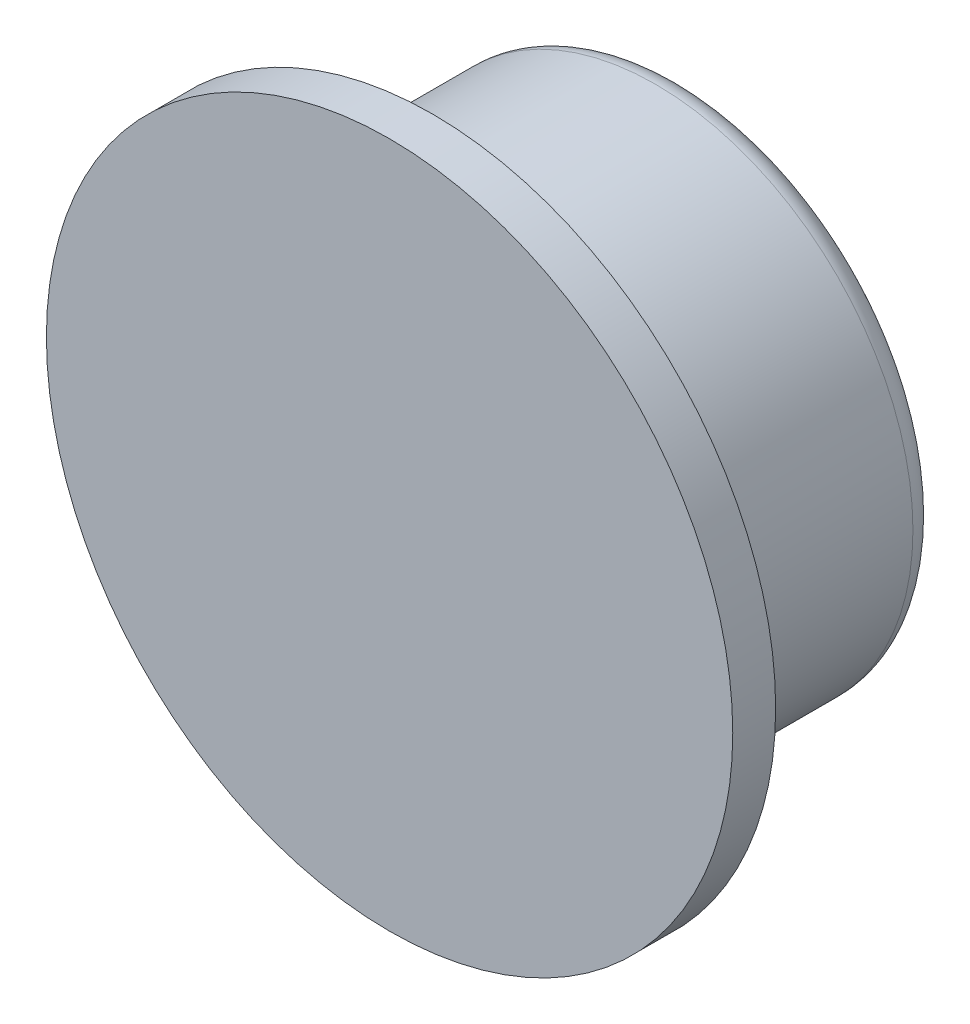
from build123d import *


with BuildPart() as part:
    # Sketch1 → Revolve1 (revolve)
    with BuildSketch(Plane(origin=(0, 0, 0), x_dir=(0, 0, -1), z_dir=(1, 0, 0)), mode=Mode.PRIVATE) as revolve1_sk:
        with BuildLine():
            Line((0, 0), (0, 40))
            Line((0, 40), (5, 40))
            Line((5, 40), (5, 30))
            Line((5, 30), (31, 30))
            ThreePointArc((31, 30), (33.121320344, 29.121320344), (34, 27))
            Line((34, 27), (34, 5.5))
            Line((34, 5.5), (33.5, 5))
            Line((33.5, 5), (25, 5))
            Line((25, 5), (22.113248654, 0))
            Line((22.113248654, 0), (0, 0))
        make_face()
    revolve(revolve1_sk.sketch.rotate(Axis((0, 0, 0), (0, 0, -1)), 90), axis=Axis((0, 0, 0), (0, 0, -1)))


solid = part.part
